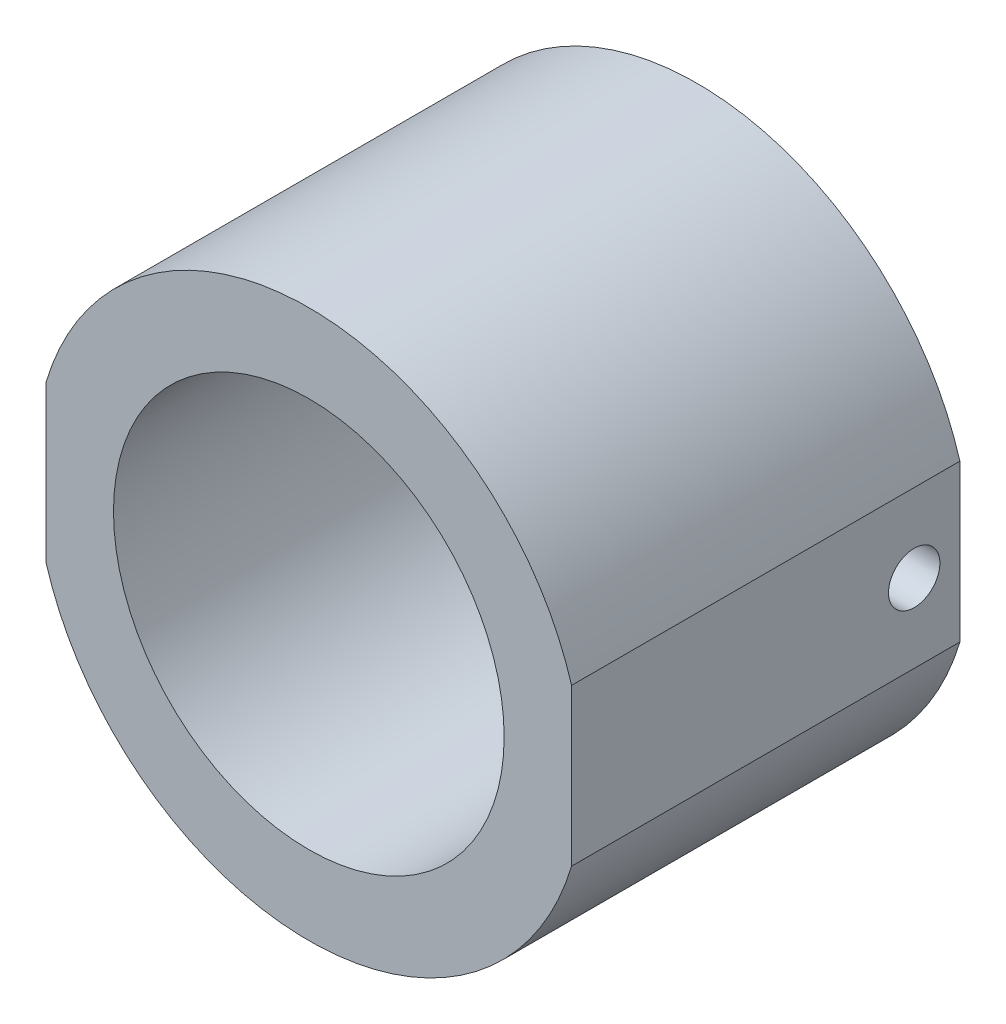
ISO-10303-21;
HEADER;
FILE_DESCRIPTION(('STEP AP214'),'2;1');
FILE_NAME('part.step','',(''),(''),'','','');
FILE_SCHEMA(('AUTOMOTIVE_DESIGN { 1 0 10303 214 1 1 1 1 }'));
ENDSEC;
DATA;
#1=APPLICATION_CONTEXT('core data for automotive mechanical design processes');
#2=APPLICATION_PROTOCOL_DEFINITION('international standard','automotive_design',2000,#1);
#3=PRODUCT_CONTEXT('',#1,'mechanical');
#4=PRODUCT('Part','Part','',(#3));
#5=PRODUCT_RELATED_PRODUCT_CATEGORY('part','',(#4));
#6=PRODUCT_DEFINITION_FORMATION('','',#4);
#7=PRODUCT_DEFINITION_CONTEXT('part definition',#1,'design');
#8=PRODUCT_DEFINITION('design','',#6,#7);
#9=PRODUCT_DEFINITION_SHAPE('','',#8);
#10=(LENGTH_UNIT() NAMED_UNIT(*) SI_UNIT(.MILLI.,.METRE.));
#11=(NAMED_UNIT(*) PLANE_ANGLE_UNIT() SI_UNIT($,.RADIAN.));
#12=(NAMED_UNIT(*) SI_UNIT($,.STERADIAN.) SOLID_ANGLE_UNIT());
#13=UNCERTAINTY_MEASURE_WITH_UNIT(LENGTH_MEASURE(1.E-05),#10,'distance_accuracy_value','');
#14=(GEOMETRIC_REPRESENTATION_CONTEXT(3) GLOBAL_UNCERTAINTY_ASSIGNED_CONTEXT((#13)) GLOBAL_UNIT_ASSIGNED_CONTEXT((#10,
#11,#12)) REPRESENTATION_CONTEXT('',''));
#15=CARTESIAN_POINT('',(0.,0.,0.));
#16=DIRECTION('',(0.,0.,1.));
#17=DIRECTION('',(1.,0.,0.));
#18=AXIS2_PLACEMENT_3D('',#15,#16,#17);
#19=CARTESIAN_POINT('',(0.,0.,-17.));
#20=DIRECTION('',(0.,0.,1.));
#21=DIRECTION('',(1.,0.,0.));
#22=AXIS2_PLACEMENT_3D('',#19,#20,#21);
#23=CYLINDRICAL_SURFACE('',#22,24.);
#24=DIRECTION('',(0.,0.,1.));
#25=VECTOR('',#24,1.);
#26=CARTESIAN_POINT('',(23.,-6.85565460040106,-17.));
#27=LINE('',#26,#25);
#28=CARTESIAN_POINT('',(23.,-6.85565460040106,17.));
#29=VERTEX_POINT('',#28);
#30=CARTESIAN_POINT('',(23.,-6.85565460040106,-17.));
#31=VERTEX_POINT('',#30);
#32=EDGE_CURVE('E113',#29,#31,#27,.F.);
#33=ORIENTED_EDGE('',*,*,#32,.F.);
#34=CARTESIAN_POINT('',(0.,0.,17.));
#35=DIRECTION('',(0.,0.,1.));
#36=DIRECTION('',(1.,0.,0.));
#37=AXIS2_PLACEMENT_3D('',#34,#35,#36);
#38=CIRCLE('',#37,24.);
#39=CARTESIAN_POINT('',(-23.,-6.85565460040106,17.));
#40=VERTEX_POINT('',#39);
#41=EDGE_CURVE('E99',#40,#29,#38,.T.);
#42=ORIENTED_EDGE('',*,*,#41,.F.);
#43=DIRECTION('',(0.,0.,1.));
#44=VECTOR('',#43,1.);
#45=CARTESIAN_POINT('',(-23.,-6.85565460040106,-17.));
#46=LINE('',#45,#44);
#47=CARTESIAN_POINT('',(-23.,-6.85565460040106,-17.));
#48=VERTEX_POINT('',#47);
#49=EDGE_CURVE('E57',#48,#40,#46,.T.);
#50=ORIENTED_EDGE('',*,*,#49,.F.);
#51=CARTESIAN_POINT('',(0.,0.,-17.));
#52=DIRECTION('',(0.,0.,1.));
#53=DIRECTION('',(1.,0.,0.));
#54=AXIS2_PLACEMENT_3D('',#51,#52,#53);
#55=CIRCLE('',#54,24.);
#56=EDGE_CURVE('E98',#48,#31,#55,.T.);
#57=ORIENTED_EDGE('',*,*,#56,.T.);
#58=EDGE_LOOP('',(#33,#42,#50,#57));
#59=FACE_BOUND('',#58,.T.);
#60=ADVANCED_FACE('F41',(#59),#23,.T.);
#61=DIRECTION('',(0.,0.,1.));
#62=VECTOR('',#61,1.);
#63=CARTESIAN_POINT('',(23.,6.85565460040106,-17.));
#64=LINE('',#63,#62);
#65=CARTESIAN_POINT('',(23.,6.85565460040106,-17.));
#66=VERTEX_POINT('',#65);
#67=CARTESIAN_POINT('',(23.,6.85565460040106,17.));
#68=VERTEX_POINT('',#67);
#69=EDGE_CURVE('E64',#66,#68,#64,.T.);
#70=ORIENTED_EDGE('',*,*,#69,.F.);
#71=CARTESIAN_POINT('',(-23.,6.85565460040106,-17.));
#72=VERTEX_POINT('',#71);
#73=EDGE_CURVE('E87',#66,#72,#55,.T.);
#74=ORIENTED_EDGE('',*,*,#73,.T.);
#75=DIRECTION('',(0.,0.,1.));
#76=VECTOR('',#75,1.);
#77=CARTESIAN_POINT('',(-23.,6.85565460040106,-17.));
#78=LINE('',#77,#76);
#79=CARTESIAN_POINT('',(-23.,6.85565460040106,17.));
#80=VERTEX_POINT('',#79);
#81=EDGE_CURVE('E81',#80,#72,#78,.F.);
#82=ORIENTED_EDGE('',*,*,#81,.F.);
#83=EDGE_CURVE('E92',#68,#80,#38,.T.);
#84=ORIENTED_EDGE('',*,*,#83,.F.);
#85=EDGE_LOOP('',(#70,#74,#82,#84));
#86=FACE_BOUND('',#85,.T.);
#87=ADVANCED_FACE('F43',(#86),#23,.T.);
#88=CARTESIAN_POINT('',(0.,0.,-17.));
#89=DIRECTION('',(0.,0.,1.));
#90=DIRECTION('',(1.,0.,0.));
#91=AXIS2_PLACEMENT_3D('',#88,#89,#90);
#92=PLANE('',#91);
#93=CARTESIAN_POINT('',(0.,0.,-17.));
#94=DIRECTION('',(0.,0.,1.));
#95=DIRECTION('',(1.,0.,0.));
#96=AXIS2_PLACEMENT_3D('',#93,#94,#95);
#97=CIRCLE('',#96,17.1);
#98=CARTESIAN_POINT('',(17.1,0.,-17.));
#99=VERTEX_POINT('',#98);
#100=EDGE_CURVE('E103',#99,#99,#97,.T.);
#101=ORIENTED_EDGE('',*,*,#100,.T.);
#102=EDGE_LOOP('',(#101));
#103=FACE_BOUND('',#102,.T.);
#104=ORIENTED_EDGE('',*,*,#73,.F.);
#105=DIRECTION('',(0.,-1.,0.));
#106=VECTOR('',#105,1.);
#107=CARTESIAN_POINT('',(23.,0.,-17.));
#108=LINE('',#107,#106);
#109=EDGE_CURVE('E108',#66,#31,#108,.T.);
#110=ORIENTED_EDGE('',*,*,#109,.T.);
#111=ORIENTED_EDGE('',*,*,#56,.F.);
#112=DIRECTION('',(0.,1.,0.));
#113=VECTOR('',#112,1.);
#114=CARTESIAN_POINT('',(-23.,0.,-17.));
#115=LINE('',#114,#113);
#116=EDGE_CURVE('E94',#48,#72,#115,.T.);
#117=ORIENTED_EDGE('',*,*,#116,.T.);
#118=EDGE_LOOP('',(#104,#110,#111,#117));
#119=FACE_BOUND('',#118,.T.);
#120=ADVANCED_FACE('F157',(#103,#119),#92,.F.);
#121=CARTESIAN_POINT('',(0.,0.,17.));
#122=DIRECTION('',(0.,0.,1.));
#123=DIRECTION('',(1.,0.,0.));
#124=AXIS2_PLACEMENT_3D('',#121,#122,#123);
#125=PLANE('',#124);
#126=DIRECTION('',(0.,-1.,0.));
#127=VECTOR('',#126,1.);
#128=CARTESIAN_POINT('',(23.,0.,17.));
#129=LINE('',#128,#127);
#130=EDGE_CURVE('E11',#68,#29,#129,.T.);
#131=ORIENTED_EDGE('',*,*,#130,.F.);
#132=ORIENTED_EDGE('',*,*,#83,.T.);
#133=DIRECTION('',(0.,1.,0.));
#134=VECTOR('',#133,1.);
#135=CARTESIAN_POINT('',(-23.,0.,17.));
#136=LINE('',#135,#134);
#137=EDGE_CURVE('E50',#40,#80,#136,.T.);
#138=ORIENTED_EDGE('',*,*,#137,.F.);
#139=ORIENTED_EDGE('',*,*,#41,.T.);
#140=EDGE_LOOP('',(#131,#132,#138,#139));
#141=FACE_BOUND('',#140,.T.);
#142=CARTESIAN_POINT('',(0.,0.,17.));
#143=DIRECTION('',(0.,0.,1.));
#144=DIRECTION('',(1.,0.,0.));
#145=AXIS2_PLACEMENT_3D('',#142,#143,#144);
#146=CIRCLE('',#145,17.1);
#147=CARTESIAN_POINT('',(17.1,0.,17.));
#148=VERTEX_POINT('',#147);
#149=EDGE_CURVE('E105',#148,#148,#146,.T.);
#150=ORIENTED_EDGE('',*,*,#149,.F.);
#151=EDGE_LOOP('',(#150));
#152=FACE_BOUND('',#151,.T.);
#153=ADVANCED_FACE('F96',(#141,#152),#125,.T.);
#154=CARTESIAN_POINT('',(0.,0.,-17.));
#155=DIRECTION('',(0.,0.,1.));
#156=DIRECTION('',(1.,0.,0.));
#157=AXIS2_PLACEMENT_3D('',#154,#155,#156);
#158=CYLINDRICAL_SURFACE('',#157,17.1);
#159=CARTESIAN_POINT('',(17.1,0.,-15.25));
#160=CARTESIAN_POINT('',(17.0999981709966,0.125800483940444,-15.2499946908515));
#161=CARTESIAN_POINT('',(17.0985971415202,0.25167820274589,-15.2394139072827));
#162=CARTESIAN_POINT('',(17.0931429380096,0.499927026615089,-15.1973743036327));
#163=CARTESIAN_POINT('',(17.0890870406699,0.622294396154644,-15.165894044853));
#164=CARTESIAN_POINT('',(17.0787797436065,0.859892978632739,-15.0830023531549));
#165=CARTESIAN_POINT('',(17.072529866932,0.975129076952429,-15.0316047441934));
#166=CARTESIAN_POINT('',(17.0585286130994,1.1953195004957,-14.9103684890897));
#167=CARTESIAN_POINT('',(17.0507774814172,1.3002755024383,-14.8405328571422));
#168=CARTESIAN_POINT('',(17.0345856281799,1.49758477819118,-14.6839498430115));
#169=CARTESIAN_POINT('',(17.0261413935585,1.58986658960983,-14.5971127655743));
#170=CARTESIAN_POINT('',(17.0095431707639,1.75859219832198,-14.4091845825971));
#171=CARTESIAN_POINT('',(17.0013891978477,1.83503516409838,-14.3080927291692));
#172=CARTESIAN_POINT('',(16.9862603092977,1.97018246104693,-14.0940561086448));
#173=CARTESIAN_POINT('',(16.9792899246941,2.02881927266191,-13.9810683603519));
#174=CARTESIAN_POINT('',(16.9673642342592,2.12625851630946,-13.746741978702));
#175=CARTESIAN_POINT('',(16.9624088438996,2.16506178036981,-13.6254036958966));
#176=CARTESIAN_POINT('',(16.9551080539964,2.22151403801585,-13.3785649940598));
#177=CARTESIAN_POINT('',(16.9527477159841,2.23928415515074,-13.2530927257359));
#178=CARTESIAN_POINT('',(16.9508586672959,2.25354059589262,-13.0009264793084));
#179=CARTESIAN_POINT('',(16.9513298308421,2.25002786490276,-12.8742325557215));
#180=CARTESIAN_POINT('',(16.9550368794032,2.22191763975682,-12.62406631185));
#181=CARTESIAN_POINT('',(16.9582552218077,2.19745392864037,-12.5005786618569));
#182=CARTESIAN_POINT('',(16.9670666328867,2.12834508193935,-12.2594766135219));
#183=CARTESIAN_POINT('',(16.9726597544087,2.08369949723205,-12.1418623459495));
#184=CARTESIAN_POINT('',(16.9856102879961,1.9753515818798,-11.9154321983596));
#185=CARTESIAN_POINT('',(16.9929730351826,1.91159147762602,-11.8066442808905));
#186=CARTESIAN_POINT('',(17.0086291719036,1.76686572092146,-11.6012614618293));
#187=CARTESIAN_POINT('',(17.0169226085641,1.68589919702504,-11.5046671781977));
#188=CARTESIAN_POINT('',(17.0335835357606,1.50831925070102,-11.3256373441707));
#189=CARTESIAN_POINT('',(17.0419511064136,1.4115905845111,-11.2433160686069));
#190=CARTESIAN_POINT('',(17.0577580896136,1.20562793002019,-11.0960600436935));
#191=CARTESIAN_POINT('',(17.0651974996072,1.09639390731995,-11.0311253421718));
#192=CARTESIAN_POINT('',(17.0783152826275,0.868430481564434,-10.920484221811));
#193=CARTESIAN_POINT('',(17.0839929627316,0.749697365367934,-10.8747853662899));
#194=CARTESIAN_POINT('',(17.0929414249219,0.506151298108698,-10.8040059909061));
#195=CARTESIAN_POINT('',(17.0962123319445,0.381338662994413,-10.7789244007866));
#196=CARTESIAN_POINT('',(17.0999623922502,0.130164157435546,-10.750240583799));
#197=CARTESIAN_POINT('',(17.1004619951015,0.00382054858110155,-10.7464810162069));
#198=CARTESIAN_POINT('',(17.0986684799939,-0.247694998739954,-10.7601321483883));
#199=CARTESIAN_POINT('',(17.0963754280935,-0.37286696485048,-10.7775423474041));
#200=CARTESIAN_POINT('',(17.0892669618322,-0.618018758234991,-10.832908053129));
#201=CARTESIAN_POINT('',(17.0844608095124,-0.738015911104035,-10.870788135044));
#202=CARTESIAN_POINT('',(17.0728639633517,-0.969954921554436,-10.965939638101));
#203=CARTESIAN_POINT('',(17.0660731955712,-1.08189647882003,-11.0232117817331));
#204=CARTESIAN_POINT('',(17.0512126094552,-1.2952467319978,-11.1558994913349));
#205=CARTESIAN_POINT('',(17.0431357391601,-1.39659193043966,-11.2314163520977));
#206=CARTESIAN_POINT('',(17.0266274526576,-1.58522564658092,-11.3983071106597));
#207=CARTESIAN_POINT('',(17.0181960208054,-1.67251354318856,-11.4896817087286));
#208=CARTESIAN_POINT('',(17.0018653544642,-1.83111664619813,-11.6863890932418));
#209=CARTESIAN_POINT('',(16.9939698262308,-1.90232725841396,-11.7918065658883));
#210=CARTESIAN_POINT('',(16.9796670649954,-2.02603071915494,-12.0131983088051));
#211=CARTESIAN_POINT('',(16.9732597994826,-2.07852397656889,-12.1291723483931));
#212=CARTESIAN_POINT('',(16.9626846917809,-2.16313506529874,-12.3680539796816));
#213=CARTESIAN_POINT('',(16.9585104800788,-2.19531089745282,-12.4909407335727));
#214=CARTESIAN_POINT('',(16.9528561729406,-2.23856007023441,-12.7404317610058));
#215=CARTESIAN_POINT('',(16.9513759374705,-2.24963450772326,-12.8670358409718));
#216=CARTESIAN_POINT('',(16.9512815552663,-2.25034493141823,-13.119326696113));
#217=CARTESIAN_POINT('',(16.9526454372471,-2.24014526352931,-13.2450130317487));
#218=CARTESIAN_POINT('',(16.9580382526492,-2.19894605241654,-13.4928679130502));
#219=CARTESIAN_POINT('',(16.9620671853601,-2.16794651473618,-13.6150364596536));
#220=CARTESIAN_POINT('',(16.9723291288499,-2.08608061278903,-13.8523602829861));
#221=CARTESIAN_POINT('',(16.9785611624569,-2.03522305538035,-13.9675186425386));
#222=CARTESIAN_POINT('',(16.9925286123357,-1.91510092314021,-14.1876937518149));
#223=CARTESIAN_POINT('',(17.0002640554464,-1.84583601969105,-14.2927103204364));
#224=CARTESIAN_POINT('',(17.0164382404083,-1.69025857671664,-14.4904597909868));
#225=CARTESIAN_POINT('',(17.0248817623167,-1.60382369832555,-14.583096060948));
#226=CARTESIAN_POINT('',(17.0414790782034,-1.41661651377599,-14.75261089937));
#227=CARTESIAN_POINT('',(17.0496328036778,-1.31584084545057,-14.8294857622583));
#228=CARTESIAN_POINT('',(17.0647701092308,-1.10232251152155,-14.9655750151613));
#229=CARTESIAN_POINT('',(17.0717486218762,-0.989531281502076,-15.0247137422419));
#230=CARTESIAN_POINT('',(17.083698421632,-0.755586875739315,-15.1231245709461));
#231=CARTESIAN_POINT('',(17.0886718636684,-0.634442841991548,-15.1624180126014));
#232=CARTESIAN_POINT('',(17.0948677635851,-0.427242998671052,-15.2107370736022));
#233=CARTESIAN_POINT('',(17.0967828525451,-0.34248751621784,-15.2254391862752));
#234=CARTESIAN_POINT('',(17.0993495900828,-0.171833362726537,-15.2450724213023));
#235=CARTESIAN_POINT('',(17.1000012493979,-0.0859347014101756,-15.2500036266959));
#236=CARTESIAN_POINT('',(17.1,0.,-15.25));
#237=B_SPLINE_CURVE_WITH_KNOTS('',3,(#159,#160,#161,#162,#163,#164,#165,#166,#167,#168,#169,
#170,#171,#172,#173,#174,#175,#176,#177,#178,#179,#180,#181,#182,#183,#184,#185,#186,#187,#188,
#189,#190,#191,#192,#193,#194,#195,#196,#197,#198,#199,#200,#201,#202,#203,#204,#205,#206,#207,
#208,#209,#210,#211,#212,#213,#214,#215,#216,#217,#218,#219,#220,#221,#222,#223,#224,#225,#226,
#227,#228,#229,#230,#231,#232,#233,#234,#235,#236),.UNSPECIFIED.,.T.,.F.,(4,2,2,2,2,2,2,2,2,2,2,
2,2,2,2,2,2,2,2,2,2,2,2,2,2,2,2,2,2,2,2,2,2,2,2,2,2,2,4),(0.,0.377087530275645,0.75456247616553,
1.13177589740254,1.50892769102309,1.88812563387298,2.26734347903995,2.64798183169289,
3.02860421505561,3.40702387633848,3.78542672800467,4.16143114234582,4.53744392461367,
4.91460486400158,5.29178490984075,5.67185780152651,6.05193173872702,6.4321549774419,
6.81235847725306,7.18975266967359,7.56713793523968,7.94314204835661,8.31916017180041,
8.69731596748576,9.07548846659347,9.45605456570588,9.83661235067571,10.2160787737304,
10.5955254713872,10.9720517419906,11.3485779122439,11.7249372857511,12.1013033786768,
12.4804540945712,12.8596938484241,13.2405291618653,13.6209540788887,13.87854593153,
14.1361355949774),.UNSPECIFIED.);
#238=CARTESIAN_POINT('',(17.1,0.,-15.25));
#239=VERTEX_POINT('',#238);
#240=EDGE_CURVE('E118',#239,#239,#237,.T.);
#241=ORIENTED_EDGE('',*,*,#240,.T.);
#242=EDGE_LOOP('',(#241));
#243=FACE_BOUND('',#242,.T.);
#244=CARTESIAN_POINT('',(-17.1,0.,-15.25));
#245=CARTESIAN_POINT('',(-17.0999981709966,-0.125800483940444,-15.2499946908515));
#246=CARTESIAN_POINT('',(-17.0985971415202,-0.25167820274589,-15.2394139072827));
#247=CARTESIAN_POINT('',(-17.0931429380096,-0.499927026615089,-15.1973743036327));
#248=CARTESIAN_POINT('',(-17.0890870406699,-0.622294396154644,-15.165894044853));
#249=CARTESIAN_POINT('',(-17.0787797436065,-0.859892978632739,-15.0830023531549));
#250=CARTESIAN_POINT('',(-17.072529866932,-0.975129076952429,-15.0316047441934));
#251=CARTESIAN_POINT('',(-17.0585286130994,-1.1953195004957,-14.9103684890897));
#252=CARTESIAN_POINT('',(-17.0507774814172,-1.3002755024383,-14.8405328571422));
#253=CARTESIAN_POINT('',(-17.0345856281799,-1.49758477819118,-14.6839498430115));
#254=CARTESIAN_POINT('',(-17.0261413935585,-1.58986658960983,-14.5971127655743));
#255=CARTESIAN_POINT('',(-17.0095431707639,-1.75859219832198,-14.4091845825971));
#256=CARTESIAN_POINT('',(-17.0013891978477,-1.83503516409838,-14.3080927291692));
#257=CARTESIAN_POINT('',(-16.9862603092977,-1.97018246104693,-14.0940561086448));
#258=CARTESIAN_POINT('',(-16.9792899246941,-2.02881927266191,-13.9810683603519));
#259=CARTESIAN_POINT('',(-16.9673642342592,-2.12625851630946,-13.746741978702));
#260=CARTESIAN_POINT('',(-16.9624088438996,-2.16506178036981,-13.6254036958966));
#261=CARTESIAN_POINT('',(-16.9551080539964,-2.22151403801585,-13.3785649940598));
#262=CARTESIAN_POINT('',(-16.9527477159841,-2.23928415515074,-13.2530927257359));
#263=CARTESIAN_POINT('',(-16.9508586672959,-2.25354059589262,-13.0009264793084));
#264=CARTESIAN_POINT('',(-16.9513298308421,-2.25002786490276,-12.8742325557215));
#265=CARTESIAN_POINT('',(-16.9550368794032,-2.22191763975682,-12.62406631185));
#266=CARTESIAN_POINT('',(-16.9582552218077,-2.19745392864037,-12.5005786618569));
#267=CARTESIAN_POINT('',(-16.9670666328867,-2.12834508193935,-12.2594766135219));
#268=CARTESIAN_POINT('',(-16.9726597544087,-2.08369949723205,-12.1418623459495));
#269=CARTESIAN_POINT('',(-16.9856102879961,-1.9753515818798,-11.9154321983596));
#270=CARTESIAN_POINT('',(-16.9929730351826,-1.91159147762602,-11.8066442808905));
#271=CARTESIAN_POINT('',(-17.0086291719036,-1.76686572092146,-11.6012614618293));
#272=CARTESIAN_POINT('',(-17.0169226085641,-1.68589919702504,-11.5046671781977));
#273=CARTESIAN_POINT('',(-17.0335835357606,-1.50831925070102,-11.3256373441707));
#274=CARTESIAN_POINT('',(-17.0419511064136,-1.4115905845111,-11.2433160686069));
#275=CARTESIAN_POINT('',(-17.0577580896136,-1.20562793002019,-11.0960600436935));
#276=CARTESIAN_POINT('',(-17.0651974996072,-1.09639390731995,-11.0311253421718));
#277=CARTESIAN_POINT('',(-17.0783152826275,-0.868430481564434,-10.920484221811));
#278=CARTESIAN_POINT('',(-17.0839929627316,-0.749697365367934,-10.8747853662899));
#279=CARTESIAN_POINT('',(-17.0929414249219,-0.506151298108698,-10.8040059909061));
#280=CARTESIAN_POINT('',(-17.0962123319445,-0.381338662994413,-10.7789244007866));
#281=CARTESIAN_POINT('',(-17.0999623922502,-0.130164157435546,-10.750240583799));
#282=CARTESIAN_POINT('',(-17.1004619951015,-0.00382054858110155,-10.7464810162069));
#283=CARTESIAN_POINT('',(-17.0986684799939,0.247694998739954,-10.7601321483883));
#284=CARTESIAN_POINT('',(-17.0963754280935,0.37286696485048,-10.7775423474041));
#285=CARTESIAN_POINT('',(-17.0892669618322,0.618018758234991,-10.832908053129));
#286=CARTESIAN_POINT('',(-17.0844608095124,0.738015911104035,-10.870788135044));
#287=CARTESIAN_POINT('',(-17.0728639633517,0.969954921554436,-10.965939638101));
#288=CARTESIAN_POINT('',(-17.0660731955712,1.08189647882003,-11.0232117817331));
#289=CARTESIAN_POINT('',(-17.0512126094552,1.2952467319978,-11.1558994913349));
#290=CARTESIAN_POINT('',(-17.0431357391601,1.39659193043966,-11.2314163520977));
#291=CARTESIAN_POINT('',(-17.0266274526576,1.58522564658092,-11.3983071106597));
#292=CARTESIAN_POINT('',(-17.0181960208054,1.67251354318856,-11.4896817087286));
#293=CARTESIAN_POINT('',(-17.0018653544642,1.83111664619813,-11.6863890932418));
#294=CARTESIAN_POINT('',(-16.9939698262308,1.90232725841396,-11.7918065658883));
#295=CARTESIAN_POINT('',(-16.9796670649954,2.02603071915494,-12.0131983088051));
#296=CARTESIAN_POINT('',(-16.9732597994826,2.07852397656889,-12.1291723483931));
#297=CARTESIAN_POINT('',(-16.9626846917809,2.16313506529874,-12.3680539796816));
#298=CARTESIAN_POINT('',(-16.9585104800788,2.19531089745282,-12.4909407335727));
#299=CARTESIAN_POINT('',(-16.9528561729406,2.23856007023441,-12.7404317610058));
#300=CARTESIAN_POINT('',(-16.9513759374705,2.24963450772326,-12.8670358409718));
#301=CARTESIAN_POINT('',(-16.9512815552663,2.25034493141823,-13.119326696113));
#302=CARTESIAN_POINT('',(-16.9526454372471,2.24014526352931,-13.2450130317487));
#303=CARTESIAN_POINT('',(-16.9580382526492,2.19894605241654,-13.4928679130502));
#304=CARTESIAN_POINT('',(-16.9620671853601,2.16794651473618,-13.6150364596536));
#305=CARTESIAN_POINT('',(-16.9723291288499,2.08608061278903,-13.8523602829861));
#306=CARTESIAN_POINT('',(-16.9785611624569,2.03522305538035,-13.9675186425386));
#307=CARTESIAN_POINT('',(-16.9925286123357,1.91510092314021,-14.1876937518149));
#308=CARTESIAN_POINT('',(-17.0002640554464,1.84583601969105,-14.2927103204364));
#309=CARTESIAN_POINT('',(-17.0164382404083,1.69025857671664,-14.4904597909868));
#310=CARTESIAN_POINT('',(-17.0248817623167,1.60382369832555,-14.583096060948));
#311=CARTESIAN_POINT('',(-17.0414790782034,1.41661651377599,-14.75261089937));
#312=CARTESIAN_POINT('',(-17.0496328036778,1.31584084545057,-14.8294857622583));
#313=CARTESIAN_POINT('',(-17.0647701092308,1.10232251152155,-14.9655750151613));
#314=CARTESIAN_POINT('',(-17.0717486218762,0.989531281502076,-15.0247137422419));
#315=CARTESIAN_POINT('',(-17.083698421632,0.755586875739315,-15.1231245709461));
#316=CARTESIAN_POINT('',(-17.0886718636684,0.634442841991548,-15.1624180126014));
#317=CARTESIAN_POINT('',(-17.0948677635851,0.427242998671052,-15.2107370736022));
#318=CARTESIAN_POINT('',(-17.0967828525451,0.34248751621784,-15.2254391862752));
#319=CARTESIAN_POINT('',(-17.0993495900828,0.171833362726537,-15.2450724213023));
#320=CARTESIAN_POINT('',(-17.1000012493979,0.0859347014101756,-15.2500036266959));
#321=CARTESIAN_POINT('',(-17.1,0.,-15.25));
#322=B_SPLINE_CURVE_WITH_KNOTS('',3,(#244,#245,#246,#247,#248,#249,#250,#251,#252,#253,#254,
#255,#256,#257,#258,#259,#260,#261,#262,#263,#264,#265,#266,#267,#268,#269,#270,#271,#272,#273,
#274,#275,#276,#277,#278,#279,#280,#281,#282,#283,#284,#285,#286,#287,#288,#289,#290,#291,#292,
#293,#294,#295,#296,#297,#298,#299,#300,#301,#302,#303,#304,#305,#306,#307,#308,#309,#310,#311,
#312,#313,#314,#315,#316,#317,#318,#319,#320,#321),.UNSPECIFIED.,.T.,.F.,(4,2,2,2,2,2,2,2,2,2,2,
2,2,2,2,2,2,2,2,2,2,2,2,2,2,2,2,2,2,2,2,2,2,2,2,2,2,2,4),(0.,0.377087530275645,0.75456247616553,
1.13177589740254,1.50892769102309,1.88812563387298,2.26734347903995,2.64798183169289,
3.02860421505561,3.40702387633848,3.78542672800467,4.16143114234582,4.53744392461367,
4.91460486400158,5.29178490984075,5.67185780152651,6.05193173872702,6.4321549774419,
6.81235847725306,7.18975266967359,7.56713793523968,7.94314204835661,8.31916017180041,
8.69731596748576,9.07548846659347,9.45605456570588,9.83661235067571,10.2160787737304,
10.5955254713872,10.9720517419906,11.3485779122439,11.7249372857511,12.1013033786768,
12.4804540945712,12.8596938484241,13.2405291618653,13.6209540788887,13.87854593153,
14.1361355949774),.UNSPECIFIED.);
#323=CARTESIAN_POINT('',(-17.1,0.,-15.25));
#324=VERTEX_POINT('',#323);
#325=EDGE_CURVE('E126',#324,#324,#322,.T.);
#326=ORIENTED_EDGE('',*,*,#325,.T.);
#327=EDGE_LOOP('',(#326));
#328=FACE_BOUND('',#327,.T.);
#329=ORIENTED_EDGE('',*,*,#100,.F.);
#330=EDGE_LOOP('',(#329));
#331=FACE_BOUND('',#330,.T.);
#332=ORIENTED_EDGE('',*,*,#149,.T.);
#333=EDGE_LOOP('',(#332));
#334=FACE_BOUND('',#333,.T.);
#335=ADVANCED_FACE('F131',(#243,#328,#331,#334),#158,.F.);
#336=CARTESIAN_POINT('',(-23.,-30.,-250.));
#337=DIRECTION('',(1.,0.,0.));
#338=DIRECTION('',(0.,0.,-1.));
#339=AXIS2_PLACEMENT_3D('',#336,#337,#338);
#340=PLANE('',#339);
#341=CARTESIAN_POINT('',(-23.,0.,-13.));
#342=DIRECTION('',(1.,0.,0.));
#343=DIRECTION('',(0.,0.,-1.));
#344=AXIS2_PLACEMENT_3D('',#341,#342,#343);
#345=CIRCLE('',#344,2.25);
#346=CARTESIAN_POINT('',(-23.,0.,-15.25));
#347=VERTEX_POINT('',#346);
#348=EDGE_CURVE('E211',#347,#347,#345,.T.);
#349=ORIENTED_EDGE('',*,*,#348,.T.);
#350=EDGE_LOOP('',(#349));
#351=FACE_BOUND('',#350,.T.);
#352=ORIENTED_EDGE('',*,*,#49,.T.);
#353=ORIENTED_EDGE('',*,*,#137,.T.);
#354=ORIENTED_EDGE('',*,*,#81,.T.);
#355=ORIENTED_EDGE('',*,*,#116,.F.);
#356=EDGE_LOOP('',(#352,#353,#354,#355));
#357=FACE_BOUND('',#356,.T.);
#358=ADVANCED_FACE('F80',(#351,#357),#340,.F.);
#359=CARTESIAN_POINT('',(23.,-30.,-250.));
#360=DIRECTION('',(-1.,0.,0.));
#361=DIRECTION('',(0.,0.,1.));
#362=AXIS2_PLACEMENT_3D('',#359,#360,#361);
#363=PLANE('',#362);
#364=CARTESIAN_POINT('',(23.,0.,-13.));
#365=DIRECTION('',(-1.,0.,0.));
#366=DIRECTION('',(0.,0.,1.));
#367=AXIS2_PLACEMENT_3D('',#364,#365,#366);
#368=CIRCLE('',#367,2.25);
#369=CARTESIAN_POINT('',(23.,0.,-10.75));
#370=VERTEX_POINT('',#369);
#371=EDGE_CURVE('E45',#370,#370,#368,.T.);
#372=ORIENTED_EDGE('',*,*,#371,.T.);
#373=EDGE_LOOP('',(#372));
#374=FACE_BOUND('',#373,.T.);
#375=ORIENTED_EDGE('',*,*,#69,.T.);
#376=ORIENTED_EDGE('',*,*,#130,.T.);
#377=ORIENTED_EDGE('',*,*,#32,.T.);
#378=ORIENTED_EDGE('',*,*,#109,.F.);
#379=EDGE_LOOP('',(#375,#376,#377,#378));
#380=FACE_BOUND('',#379,.T.);
#381=ADVANCED_FACE('F140',(#374,#380),#363,.F.);
#382=CARTESIAN_POINT('',(-250.,0.,-13.));
#383=DIRECTION('',(1.,0.,0.));
#384=DIRECTION('',(0.,0.,-1.));
#385=AXIS2_PLACEMENT_3D('',#382,#383,#384);
#386=CYLINDRICAL_SURFACE('',#385,2.25);
#387=ORIENTED_EDGE('',*,*,#371,.F.);
#388=EDGE_LOOP('',(#387));
#389=FACE_BOUND('',#388,.T.);
#390=ORIENTED_EDGE('',*,*,#240,.F.);
#391=EDGE_LOOP('',(#390));
#392=FACE_BOUND('',#391,.T.);
#393=ADVANCED_FACE('F135',(#389,#392),#386,.F.);
#394=ORIENTED_EDGE('',*,*,#348,.F.);
#395=EDGE_LOOP('',(#394));
#396=FACE_BOUND('',#395,.T.);
#397=ORIENTED_EDGE('',*,*,#325,.F.);
#398=EDGE_LOOP('',(#397));
#399=FACE_BOUND('',#398,.T.);
#400=ADVANCED_FACE('F139',(#396,#399),#386,.F.);
#401=CLOSED_SHELL('',(#60,#87,#120,#153,#335,#358,#381,#393,#400));
#402=MANIFOLD_SOLID_BREP('B2',#401);
#403=ADVANCED_BREP_SHAPE_REPRESENTATION('',(#18,#402),#14);
#404=SHAPE_DEFINITION_REPRESENTATION(#9,#403);
ENDSEC;
END-ISO-10303-21;
